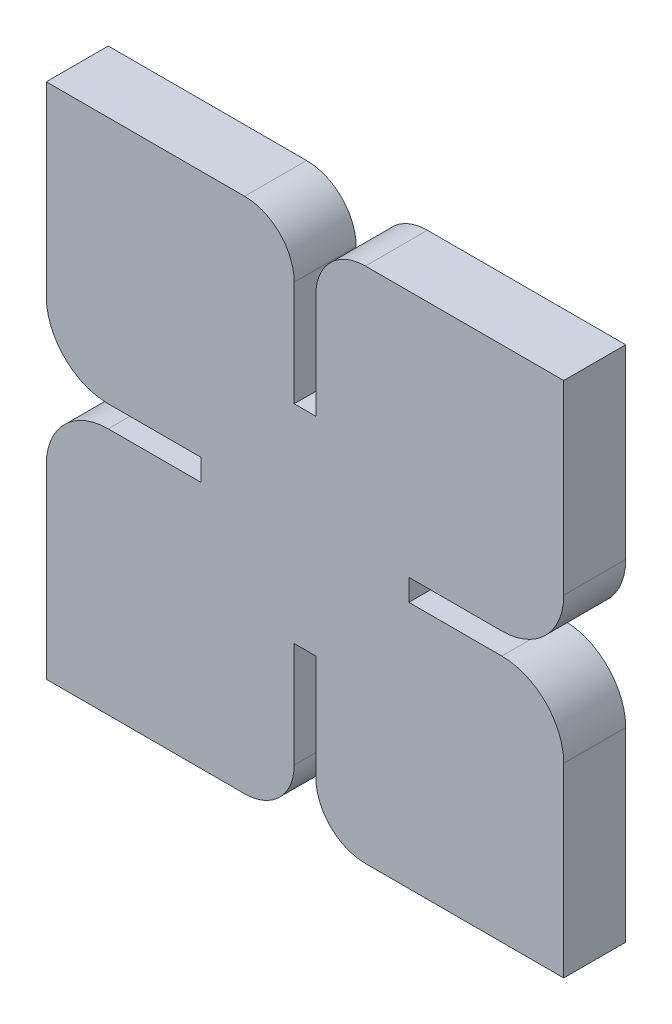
ISO-10303-21;
HEADER;
FILE_DESCRIPTION(('STEP AP214'),'2;1');
FILE_NAME('part.step','',(''),(''),'','','');
FILE_SCHEMA(('AUTOMOTIVE_DESIGN { 1 0 10303 214 1 1 1 1 }'));
ENDSEC;
DATA;
#1=APPLICATION_CONTEXT('core data for automotive mechanical design processes');
#2=APPLICATION_PROTOCOL_DEFINITION('international standard','automotive_design',2000,#1);
#3=PRODUCT_CONTEXT('',#1,'mechanical');
#4=PRODUCT('Part','Part','',(#3));
#5=PRODUCT_RELATED_PRODUCT_CATEGORY('part','',(#4));
#6=PRODUCT_DEFINITION_FORMATION('','',#4);
#7=PRODUCT_DEFINITION_CONTEXT('part definition',#1,'design');
#8=PRODUCT_DEFINITION('design','',#6,#7);
#9=PRODUCT_DEFINITION_SHAPE('','',#8);
#10=(LENGTH_UNIT() NAMED_UNIT(*) SI_UNIT(.MILLI.,.METRE.));
#11=(NAMED_UNIT(*) PLANE_ANGLE_UNIT() SI_UNIT($,.RADIAN.));
#12=(NAMED_UNIT(*) SI_UNIT($,.STERADIAN.) SOLID_ANGLE_UNIT());
#13=UNCERTAINTY_MEASURE_WITH_UNIT(LENGTH_MEASURE(1.E-05),#10,'distance_accuracy_value','');
#14=(GEOMETRIC_REPRESENTATION_CONTEXT(3) GLOBAL_UNCERTAINTY_ASSIGNED_CONTEXT((#13)) GLOBAL_UNIT_ASSIGNED_CONTEXT((#10,
#11,#12)) REPRESENTATION_CONTEXT('',''));
#15=CARTESIAN_POINT('',(0.,0.,0.));
#16=DIRECTION('',(0.,0.,1.));
#17=DIRECTION('',(1.,0.,0.));
#18=AXIS2_PLACEMENT_3D('',#15,#16,#17);
#19=CARTESIAN_POINT('',(-9.74999999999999,-33.75,10.));
#20=DIRECTION('',(0.,0.,-1.));
#21=DIRECTION('',(-1.,0.,0.));
#22=AXIS2_PLACEMENT_3D('',#19,#20,#21);
#23=CYLINDRICAL_SURFACE('',#22,8.);
#24=CARTESIAN_POINT('',(-9.74999999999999,-33.75,0.));
#25=DIRECTION('',(0.,0.,1.));
#26=DIRECTION('',(1.,0.,0.));
#27=AXIS2_PLACEMENT_3D('',#24,#25,#26);
#28=CIRCLE('',#27,8.);
#29=CARTESIAN_POINT('',(-1.74999999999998,-33.75,0.));
#30=VERTEX_POINT('',#29);
#31=CARTESIAN_POINT('',(-9.74999999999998,-41.75,0.));
#32=VERTEX_POINT('',#31);
#33=EDGE_CURVE('E246',#30,#32,#28,.F.);
#34=ORIENTED_EDGE('',*,*,#33,.F.);
#35=DIRECTION('',(0.,0.,-1.));
#36=VECTOR('',#35,1.);
#37=CARTESIAN_POINT('',(-1.74999999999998,-33.75,10.));
#38=LINE('',#37,#36);
#39=CARTESIAN_POINT('',(-1.74999999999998,-33.75,10.));
#40=VERTEX_POINT('',#39);
#41=EDGE_CURVE('E11',#40,#30,#38,.T.);
#42=ORIENTED_EDGE('',*,*,#41,.F.);
#43=CARTESIAN_POINT('',(-9.74999999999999,-33.75,10.));
#44=DIRECTION('',(0.,0.,1.));
#45=DIRECTION('',(1.,0.,0.));
#46=AXIS2_PLACEMENT_3D('',#43,#44,#45);
#47=CIRCLE('',#46,8.);
#48=CARTESIAN_POINT('',(-9.74999999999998,-41.75,10.));
#49=VERTEX_POINT('',#48);
#50=EDGE_CURVE('E319',#40,#49,#47,.F.);
#51=ORIENTED_EDGE('',*,*,#50,.T.);
#52=DIRECTION('',(0.,0.,-1.));
#53=VECTOR('',#52,1.);
#54=CARTESIAN_POINT('',(-9.74999999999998,-41.75,10.));
#55=LINE('',#54,#53);
#56=EDGE_CURVE('E146',#49,#32,#55,.T.);
#57=ORIENTED_EDGE('',*,*,#56,.T.);
#58=EDGE_LOOP('',(#34,#42,#51,#57));
#59=FACE_BOUND('',#58,.T.);
#60=ADVANCED_FACE('F35',(#59),#23,.T.);
#61=CARTESIAN_POINT('',(-1.75,0.,10.));
#62=DIRECTION('',(1.,0.,0.));
#63=DIRECTION('',(0.,1.,0.));
#64=AXIS2_PLACEMENT_3D('',#61,#62,#63);
#65=PLANE('',#64);
#66=DIRECTION('',(0.,-1.,0.));
#67=VECTOR('',#66,1.);
#68=CARTESIAN_POINT('',(-1.75,0.,0.));
#69=LINE('',#68,#67);
#70=CARTESIAN_POINT('',(-1.74999999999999,-16.75,0.));
#71=VERTEX_POINT('',#70);
#72=EDGE_CURVE('E249',#71,#30,#69,.T.);
#73=ORIENTED_EDGE('',*,*,#72,.F.);
#74=DIRECTION('',(0.,0.,-1.));
#75=VECTOR('',#74,1.);
#76=CARTESIAN_POINT('',(-1.74999999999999,-16.75,10.));
#77=LINE('',#76,#75);
#78=CARTESIAN_POINT('',(-1.74999999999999,-16.75,10.));
#79=VERTEX_POINT('',#78);
#80=EDGE_CURVE('E43',#79,#71,#77,.T.);
#81=ORIENTED_EDGE('',*,*,#80,.F.);
#82=DIRECTION('',(0.,-1.,0.));
#83=VECTOR('',#82,1.);
#84=CARTESIAN_POINT('',(-1.75,0.,10.));
#85=LINE('',#84,#83);
#86=EDGE_CURVE('E387',#79,#40,#85,.T.);
#87=ORIENTED_EDGE('',*,*,#86,.T.);
#88=ORIENTED_EDGE('',*,*,#41,.T.);
#89=EDGE_LOOP('',(#73,#81,#87,#88));
#90=FACE_BOUND('',#89,.T.);
#91=ADVANCED_FACE('F386',(#90),#65,.T.);
#92=CARTESIAN_POINT('',(0.,-16.75,10.));
#93=DIRECTION('',(0.,1.,0.));
#94=DIRECTION('',(0.,0.,1.));
#95=AXIS2_PLACEMENT_3D('',#92,#93,#94);
#96=PLANE('',#95);
#97=DIRECTION('',(1.,0.,0.));
#98=VECTOR('',#97,1.);
#99=CARTESIAN_POINT('',(0.,-16.75,0.));
#100=LINE('',#99,#98);
#101=CARTESIAN_POINT('',(1.75000000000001,-16.75,0.));
#102=VERTEX_POINT('',#101);
#103=EDGE_CURVE('E252',#71,#102,#100,.T.);
#104=ORIENTED_EDGE('',*,*,#103,.T.);
#105=DIRECTION('',(0.,0.,-1.));
#106=VECTOR('',#105,1.);
#107=CARTESIAN_POINT('',(1.75000000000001,-16.75,10.));
#108=LINE('',#107,#106);
#109=CARTESIAN_POINT('',(1.75000000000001,-16.75,10.));
#110=VERTEX_POINT('',#109);
#111=EDGE_CURVE('E370',#110,#102,#108,.T.);
#112=ORIENTED_EDGE('',*,*,#111,.F.);
#113=DIRECTION('',(1.,0.,0.));
#114=VECTOR('',#113,1.);
#115=CARTESIAN_POINT('',(0.,-16.75,10.));
#116=LINE('',#115,#114);
#117=EDGE_CURVE('E377',#79,#110,#116,.T.);
#118=ORIENTED_EDGE('',*,*,#117,.F.);
#119=ORIENTED_EDGE('',*,*,#80,.T.);
#120=EDGE_LOOP('',(#104,#112,#118,#119));
#121=FACE_BOUND('',#120,.T.);
#122=ADVANCED_FACE('F375',(#121),#96,.F.);
#123=CARTESIAN_POINT('',(1.75000000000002,0.,10.));
#124=DIRECTION('',(1.,0.,0.));
#125=DIRECTION('',(0.,1.,0.));
#126=AXIS2_PLACEMENT_3D('',#123,#124,#125);
#127=PLANE('',#126);
#128=DIRECTION('',(0.,-1.,0.));
#129=VECTOR('',#128,1.);
#130=CARTESIAN_POINT('',(1.75000000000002,0.,0.));
#131=LINE('',#130,#129);
#132=CARTESIAN_POINT('',(1.75000000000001,-33.75,0.));
#133=VERTEX_POINT('',#132);
#134=EDGE_CURVE('E254',#102,#133,#131,.T.);
#135=ORIENTED_EDGE('',*,*,#134,.T.);
#136=DIRECTION('',(0.,0.,-1.));
#137=VECTOR('',#136,1.);
#138=CARTESIAN_POINT('',(1.75000000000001,-33.75,10.));
#139=LINE('',#138,#137);
#140=CARTESIAN_POINT('',(1.75000000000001,-33.75,10.));
#141=VERTEX_POINT('',#140);
#142=EDGE_CURVE('E367',#141,#133,#139,.T.);
#143=ORIENTED_EDGE('',*,*,#142,.F.);
#144=DIRECTION('',(0.,-1.,0.));
#145=VECTOR('',#144,1.);
#146=CARTESIAN_POINT('',(1.75000000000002,0.,10.));
#147=LINE('',#146,#145);
#148=EDGE_CURVE('E395',#110,#141,#147,.T.);
#149=ORIENTED_EDGE('',*,*,#148,.F.);
#150=ORIENTED_EDGE('',*,*,#111,.T.);
#151=EDGE_LOOP('',(#135,#143,#149,#150));
#152=FACE_BOUND('',#151,.T.);
#153=ADVANCED_FACE('F538',(#152),#127,.F.);
#154=CARTESIAN_POINT('',(9.75000000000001,-33.75,10.));
#155=DIRECTION('',(0.,0.,-1.));
#156=DIRECTION('',(-1.,0.,0.));
#157=AXIS2_PLACEMENT_3D('',#154,#155,#156);
#158=CYLINDRICAL_SURFACE('',#157,8.);
#159=CARTESIAN_POINT('',(9.75000000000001,-33.75,0.));
#160=DIRECTION('',(0.,0.,1.));
#161=DIRECTION('',(1.,0.,0.));
#162=AXIS2_PLACEMENT_3D('',#159,#160,#161);
#163=CIRCLE('',#162,8.);
#164=CARTESIAN_POINT('',(9.75000000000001,-41.75,0.));
#165=VERTEX_POINT('',#164);
#166=EDGE_CURVE('E256',#133,#165,#163,.T.);
#167=ORIENTED_EDGE('',*,*,#166,.T.);
#168=DIRECTION('',(0.,0.,-1.));
#169=VECTOR('',#168,1.);
#170=CARTESIAN_POINT('',(9.75000000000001,-41.75,10.));
#171=LINE('',#170,#169);
#172=CARTESIAN_POINT('',(9.75000000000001,-41.75,10.));
#173=VERTEX_POINT('',#172);
#174=EDGE_CURVE('E365',#173,#165,#171,.T.);
#175=ORIENTED_EDGE('',*,*,#174,.F.);
#176=CARTESIAN_POINT('',(9.75000000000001,-33.75,10.));
#177=DIRECTION('',(0.,0.,1.));
#178=DIRECTION('',(1.,0.,0.));
#179=AXIS2_PLACEMENT_3D('',#176,#177,#178);
#180=CIRCLE('',#179,8.);
#181=EDGE_CURVE('E397',#141,#173,#180,.T.);
#182=ORIENTED_EDGE('',*,*,#181,.F.);
#183=ORIENTED_EDGE('',*,*,#142,.T.);
#184=EDGE_LOOP('',(#167,#175,#182,#183));
#185=FACE_BOUND('',#184,.T.);
#186=ADVANCED_FACE('F534',(#185),#158,.T.);
#187=CARTESIAN_POINT('',(0.,-41.75,10.));
#188=DIRECTION('',(0.,-1.,0.));
#189=DIRECTION('',(1.,0.,0.));
#190=AXIS2_PLACEMENT_3D('',#187,#188,#189);
#191=PLANE('',#190);
#192=DIRECTION('',(-1.,0.,0.));
#193=VECTOR('',#192,1.);
#194=CARTESIAN_POINT('',(0.,-41.75,0.));
#195=LINE('',#194,#193);
#196=CARTESIAN_POINT('',(41.75,-41.75,0.));
#197=VERTEX_POINT('',#196);
#198=EDGE_CURVE('E259',#197,#165,#195,.T.);
#199=ORIENTED_EDGE('',*,*,#198,.F.);
#200=DIRECTION('',(0.,0.,-1.));
#201=VECTOR('',#200,1.);
#202=CARTESIAN_POINT('',(41.75,-41.75,10.));
#203=LINE('',#202,#201);
#204=CARTESIAN_POINT('',(41.75,-41.75,10.));
#205=VERTEX_POINT('',#204);
#206=EDGE_CURVE('E363',#205,#197,#203,.T.);
#207=ORIENTED_EDGE('',*,*,#206,.F.);
#208=DIRECTION('',(-1.,0.,0.));
#209=VECTOR('',#208,1.);
#210=CARTESIAN_POINT('',(0.,-41.75,10.));
#211=LINE('',#210,#209);
#212=EDGE_CURVE('E399',#205,#173,#211,.T.);
#213=ORIENTED_EDGE('',*,*,#212,.T.);
#214=ORIENTED_EDGE('',*,*,#174,.T.);
#215=EDGE_LOOP('',(#199,#207,#213,#214));
#216=FACE_BOUND('',#215,.T.);
#217=ADVANCED_FACE('F529',(#216),#191,.T.);
#218=CARTESIAN_POINT('',(41.75,0.,10.));
#219=DIRECTION('',(1.,0.,0.));
#220=DIRECTION('',(0.,1.,0.));
#221=AXIS2_PLACEMENT_3D('',#218,#219,#220);
#222=PLANE('',#221);
#223=DIRECTION('',(0.,-1.,0.));
#224=VECTOR('',#223,1.);
#225=CARTESIAN_POINT('',(41.75,0.,0.));
#226=LINE('',#225,#224);
#227=CARTESIAN_POINT('',(41.75,-11.75,0.));
#228=VERTEX_POINT('',#227);
#229=EDGE_CURVE('E262',#228,#197,#226,.T.);
#230=ORIENTED_EDGE('',*,*,#229,.F.);
#231=DIRECTION('',(0.,0.,-1.));
#232=VECTOR('',#231,1.);
#233=CARTESIAN_POINT('',(41.75,-11.75,10.));
#234=LINE('',#233,#232);
#235=CARTESIAN_POINT('',(41.75,-11.75,10.));
#236=VERTEX_POINT('',#235);
#237=EDGE_CURVE('E361',#236,#228,#234,.T.);
#238=ORIENTED_EDGE('',*,*,#237,.F.);
#239=DIRECTION('',(0.,-1.,0.));
#240=VECTOR('',#239,1.);
#241=CARTESIAN_POINT('',(41.75,0.,10.));
#242=LINE('',#241,#240);
#243=EDGE_CURVE('E402',#236,#205,#242,.T.);
#244=ORIENTED_EDGE('',*,*,#243,.T.);
#245=ORIENTED_EDGE('',*,*,#206,.T.);
#246=EDGE_LOOP('',(#230,#238,#244,#245));
#247=FACE_BOUND('',#246,.T.);
#248=ADVANCED_FACE('F526',(#247),#222,.T.);
#249=CARTESIAN_POINT('',(31.75,-11.75,10.));
#250=DIRECTION('',(0.,0.,-1.));
#251=DIRECTION('',(-1.,0.,0.));
#252=AXIS2_PLACEMENT_3D('',#249,#250,#251);
#253=CYLINDRICAL_SURFACE('',#252,10.);
#254=CARTESIAN_POINT('',(31.75,-11.75,0.));
#255=DIRECTION('',(0.,0.,1.));
#256=DIRECTION('',(1.,0.,0.));
#257=AXIS2_PLACEMENT_3D('',#254,#255,#256);
#258=CIRCLE('',#257,10.);
#259=CARTESIAN_POINT('',(31.75,-1.75000000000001,0.));
#260=VERTEX_POINT('',#259);
#261=EDGE_CURVE('E265',#260,#228,#258,.F.);
#262=ORIENTED_EDGE('',*,*,#261,.F.);
#263=DIRECTION('',(0.,0.,-1.));
#264=VECTOR('',#263,1.);
#265=CARTESIAN_POINT('',(31.75,-1.75000000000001,10.));
#266=LINE('',#265,#264);
#267=CARTESIAN_POINT('',(31.75,-1.75000000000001,10.));
#268=VERTEX_POINT('',#267);
#269=EDGE_CURVE('E359',#268,#260,#266,.T.);
#270=ORIENTED_EDGE('',*,*,#269,.F.);
#271=CARTESIAN_POINT('',(31.75,-11.75,10.));
#272=DIRECTION('',(0.,0.,1.));
#273=DIRECTION('',(1.,0.,0.));
#274=AXIS2_PLACEMENT_3D('',#271,#272,#273);
#275=CIRCLE('',#274,10.);
#276=EDGE_CURVE('E405',#268,#236,#275,.F.);
#277=ORIENTED_EDGE('',*,*,#276,.T.);
#278=ORIENTED_EDGE('',*,*,#237,.T.);
#279=EDGE_LOOP('',(#262,#270,#277,#278));
#280=FACE_BOUND('',#279,.T.);
#281=ADVANCED_FACE('F520',(#280),#253,.T.);
#282=CARTESIAN_POINT('',(0.,-1.75,10.));
#283=DIRECTION('',(0.,-1.,0.));
#284=DIRECTION('',(1.,0.,0.));
#285=AXIS2_PLACEMENT_3D('',#282,#283,#284);
#286=PLANE('',#285);
#287=DIRECTION('',(-1.,0.,0.));
#288=VECTOR('',#287,1.);
#289=CARTESIAN_POINT('',(0.,-1.75,0.));
#290=LINE('',#289,#288);
#291=CARTESIAN_POINT('',(16.75,-1.75,0.));
#292=VERTEX_POINT('',#291);
#293=EDGE_CURVE('E268',#260,#292,#290,.T.);
#294=ORIENTED_EDGE('',*,*,#293,.T.);
#295=DIRECTION('',(0.,0.,-1.));
#296=VECTOR('',#295,1.);
#297=CARTESIAN_POINT('',(16.75,-1.75,10.));
#298=LINE('',#297,#296);
#299=CARTESIAN_POINT('',(16.75,-1.75,10.));
#300=VERTEX_POINT('',#299);
#301=EDGE_CURVE('E357',#300,#292,#298,.T.);
#302=ORIENTED_EDGE('',*,*,#301,.F.);
#303=DIRECTION('',(-1.,0.,0.));
#304=VECTOR('',#303,1.);
#305=CARTESIAN_POINT('',(0.,-1.75,10.));
#306=LINE('',#305,#304);
#307=EDGE_CURVE('E408',#268,#300,#306,.T.);
#308=ORIENTED_EDGE('',*,*,#307,.F.);
#309=ORIENTED_EDGE('',*,*,#269,.T.);
#310=EDGE_LOOP('',(#294,#302,#308,#309));
#311=FACE_BOUND('',#310,.T.);
#312=ADVANCED_FACE('F539',(#311),#286,.F.);
#313=CARTESIAN_POINT('',(16.75,0.,10.));
#314=DIRECTION('',(1.,0.,0.));
#315=DIRECTION('',(0.,0.,-1.));
#316=AXIS2_PLACEMENT_3D('',#313,#314,#315);
#317=PLANE('',#316);
#318=DIRECTION('',(0.,-1.,0.));
#319=VECTOR('',#318,1.);
#320=CARTESIAN_POINT('',(16.75,0.,0.));
#321=LINE('',#320,#319);
#322=CARTESIAN_POINT('',(16.75,1.75,0.));
#323=VERTEX_POINT('',#322);
#324=EDGE_CURVE('E271',#323,#292,#321,.T.);
#325=ORIENTED_EDGE('',*,*,#324,.F.);
#326=DIRECTION('',(0.,0.,-1.));
#327=VECTOR('',#326,1.);
#328=CARTESIAN_POINT('',(16.75,1.75,10.));
#329=LINE('',#328,#327);
#330=CARTESIAN_POINT('',(16.75,1.75,10.));
#331=VERTEX_POINT('',#330);
#332=EDGE_CURVE('E355',#331,#323,#329,.T.);
#333=ORIENTED_EDGE('',*,*,#332,.F.);
#334=DIRECTION('',(0.,-1.,0.));
#335=VECTOR('',#334,1.);
#336=CARTESIAN_POINT('',(16.75,0.,10.));
#337=LINE('',#336,#335);
#338=EDGE_CURVE('E410',#331,#300,#337,.T.);
#339=ORIENTED_EDGE('',*,*,#338,.T.);
#340=ORIENTED_EDGE('',*,*,#301,.T.);
#341=EDGE_LOOP('',(#325,#333,#339,#340));
#342=FACE_BOUND('',#341,.T.);
#343=ADVANCED_FACE('F514',(#342),#317,.T.);
#344=CARTESIAN_POINT('',(0.,1.75,10.));
#345=DIRECTION('',(0.,-1.,0.));
#346=DIRECTION('',(1.,0.,0.));
#347=AXIS2_PLACEMENT_3D('',#344,#345,#346);
#348=PLANE('',#347);
#349=DIRECTION('',(-1.,0.,0.));
#350=VECTOR('',#349,1.);
#351=CARTESIAN_POINT('',(0.,1.75,0.));
#352=LINE('',#351,#350);
#353=CARTESIAN_POINT('',(31.75,1.75000000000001,0.));
#354=VERTEX_POINT('',#353);
#355=EDGE_CURVE('E274',#354,#323,#352,.T.);
#356=ORIENTED_EDGE('',*,*,#355,.F.);
#357=DIRECTION('',(0.,0.,-1.));
#358=VECTOR('',#357,1.);
#359=CARTESIAN_POINT('',(31.75,1.75000000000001,10.));
#360=LINE('',#359,#358);
#361=CARTESIAN_POINT('',(31.75,1.75000000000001,10.));
#362=VERTEX_POINT('',#361);
#363=EDGE_CURVE('E353',#362,#354,#360,.T.);
#364=ORIENTED_EDGE('',*,*,#363,.F.);
#365=DIRECTION('',(-1.,0.,0.));
#366=VECTOR('',#365,1.);
#367=CARTESIAN_POINT('',(0.,1.75,10.));
#368=LINE('',#367,#366);
#369=EDGE_CURVE('E413',#362,#331,#368,.T.);
#370=ORIENTED_EDGE('',*,*,#369,.T.);
#371=ORIENTED_EDGE('',*,*,#332,.T.);
#372=EDGE_LOOP('',(#356,#364,#370,#371));
#373=FACE_BOUND('',#372,.T.);
#374=ADVANCED_FACE('F508',(#373),#348,.T.);
#375=CARTESIAN_POINT('',(31.75,11.75,10.));
#376=DIRECTION('',(0.,0.,-1.));
#377=DIRECTION('',(-1.,0.,0.));
#378=AXIS2_PLACEMENT_3D('',#375,#376,#377);
#379=CYLINDRICAL_SURFACE('',#378,10.);
#380=CARTESIAN_POINT('',(31.75,11.75,0.));
#381=DIRECTION('',(0.,0.,1.));
#382=DIRECTION('',(1.,0.,0.));
#383=AXIS2_PLACEMENT_3D('',#380,#381,#382);
#384=CIRCLE('',#383,10.);
#385=CARTESIAN_POINT('',(41.75,11.75,0.));
#386=VERTEX_POINT('',#385);
#387=EDGE_CURVE('E277',#354,#386,#384,.T.);
#388=ORIENTED_EDGE('',*,*,#387,.T.);
#389=DIRECTION('',(0.,0.,-1.));
#390=VECTOR('',#389,1.);
#391=CARTESIAN_POINT('',(41.75,11.75,10.));
#392=LINE('',#391,#390);
#393=CARTESIAN_POINT('',(41.75,11.75,10.));
#394=VERTEX_POINT('',#393);
#395=EDGE_CURVE('E350',#394,#386,#392,.T.);
#396=ORIENTED_EDGE('',*,*,#395,.F.);
#397=CARTESIAN_POINT('',(31.75,11.75,10.));
#398=DIRECTION('',(0.,0.,1.));
#399=DIRECTION('',(1.,0.,0.));
#400=AXIS2_PLACEMENT_3D('',#397,#398,#399);
#401=CIRCLE('',#400,10.);
#402=EDGE_CURVE('E416',#362,#394,#401,.T.);
#403=ORIENTED_EDGE('',*,*,#402,.F.);
#404=ORIENTED_EDGE('',*,*,#363,.T.);
#405=EDGE_LOOP('',(#388,#396,#403,#404));
#406=FACE_BOUND('',#405,.T.);
#407=ADVANCED_FACE('F591',(#406),#379,.T.);
#408=CARTESIAN_POINT('',(41.75,0.,10.));
#409=DIRECTION('',(-1.,0.,0.));
#410=DIRECTION('',(0.,-1.,0.));
#411=AXIS2_PLACEMENT_3D('',#408,#409,#410);
#412=PLANE('',#411);
#413=DIRECTION('',(0.,1.,0.));
#414=VECTOR('',#413,1.);
#415=CARTESIAN_POINT('',(41.75,0.,0.));
#416=LINE('',#415,#414);
#417=CARTESIAN_POINT('',(41.75,41.75,0.));
#418=VERTEX_POINT('',#417);
#419=EDGE_CURVE('E279',#386,#418,#416,.T.);
#420=ORIENTED_EDGE('',*,*,#419,.T.);
#421=DIRECTION('',(0.,0.,-1.));
#422=VECTOR('',#421,1.);
#423=CARTESIAN_POINT('',(41.75,41.75,10.));
#424=LINE('',#423,#422);
#425=CARTESIAN_POINT('',(41.75,41.75,10.));
#426=VERTEX_POINT('',#425);
#427=EDGE_CURVE('E347',#426,#418,#424,.T.);
#428=ORIENTED_EDGE('',*,*,#427,.F.);
#429=DIRECTION('',(0.,1.,0.));
#430=VECTOR('',#429,1.);
#431=CARTESIAN_POINT('',(41.75,0.,10.));
#432=LINE('',#431,#430);
#433=EDGE_CURVE('E418',#394,#426,#432,.T.);
#434=ORIENTED_EDGE('',*,*,#433,.F.);
#435=ORIENTED_EDGE('',*,*,#395,.T.);
#436=EDGE_LOOP('',(#420,#428,#434,#435));
#437=FACE_BOUND('',#436,.T.);
#438=ADVANCED_FACE('F502',(#437),#412,.F.);
#439=CARTESIAN_POINT('',(0.,41.75,10.));
#440=DIRECTION('',(0.,-1.,0.));
#441=DIRECTION('',(1.,0.,0.));
#442=AXIS2_PLACEMENT_3D('',#439,#440,#441);
#443=PLANE('',#442);
#444=DIRECTION('',(-1.,0.,0.));
#445=VECTOR('',#444,1.);
#446=CARTESIAN_POINT('',(0.,41.75,0.));
#447=LINE('',#446,#445);
#448=CARTESIAN_POINT('',(9.75000000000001,41.75,0.));
#449=VERTEX_POINT('',#448);
#450=EDGE_CURVE('E281',#418,#449,#447,.T.);
#451=ORIENTED_EDGE('',*,*,#450,.T.);
#452=DIRECTION('',(0.,0.,-1.));
#453=VECTOR('',#452,1.);
#454=CARTESIAN_POINT('',(9.75000000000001,41.75,10.));
#455=LINE('',#454,#453);
#456=CARTESIAN_POINT('',(9.75000000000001,41.75,10.));
#457=VERTEX_POINT('',#456);
#458=EDGE_CURVE('E345',#457,#449,#455,.T.);
#459=ORIENTED_EDGE('',*,*,#458,.F.);
#460=DIRECTION('',(-1.,0.,0.));
#461=VECTOR('',#460,1.);
#462=CARTESIAN_POINT('',(0.,41.75,10.));
#463=LINE('',#462,#461);
#464=EDGE_CURVE('E420',#426,#457,#463,.T.);
#465=ORIENTED_EDGE('',*,*,#464,.F.);
#466=ORIENTED_EDGE('',*,*,#427,.T.);
#467=EDGE_LOOP('',(#451,#459,#465,#466));
#468=FACE_BOUND('',#467,.T.);
#469=ADVANCED_FACE('F498',(#468),#443,.F.);
#470=CARTESIAN_POINT('',(9.75000000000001,33.75,10.));
#471=DIRECTION('',(0.,0.,-1.));
#472=DIRECTION('',(-1.,0.,0.));
#473=AXIS2_PLACEMENT_3D('',#470,#471,#472);
#474=CYLINDRICAL_SURFACE('',#473,8.);
#475=CARTESIAN_POINT('',(9.75000000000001,33.75,0.));
#476=DIRECTION('',(0.,0.,1.));
#477=DIRECTION('',(1.,0.,0.));
#478=AXIS2_PLACEMENT_3D('',#475,#476,#477);
#479=CIRCLE('',#478,8.);
#480=CARTESIAN_POINT('',(1.75000000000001,33.75,0.));
#481=VERTEX_POINT('',#480);
#482=EDGE_CURVE('E284',#481,#449,#479,.F.);
#483=ORIENTED_EDGE('',*,*,#482,.F.);
#484=DIRECTION('',(0.,0.,-1.));
#485=VECTOR('',#484,1.);
#486=CARTESIAN_POINT('',(1.75000000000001,33.75,10.));
#487=LINE('',#486,#485);
#488=CARTESIAN_POINT('',(1.75000000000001,33.75,10.));
#489=VERTEX_POINT('',#488);
#490=EDGE_CURVE('E343',#489,#481,#487,.T.);
#491=ORIENTED_EDGE('',*,*,#490,.F.);
#492=CARTESIAN_POINT('',(9.75000000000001,33.75,10.));
#493=DIRECTION('',(0.,0.,1.));
#494=DIRECTION('',(1.,0.,0.));
#495=AXIS2_PLACEMENT_3D('',#492,#493,#494);
#496=CIRCLE('',#495,8.);
#497=EDGE_CURVE('E422',#489,#457,#496,.F.);
#498=ORIENTED_EDGE('',*,*,#497,.T.);
#499=ORIENTED_EDGE('',*,*,#458,.T.);
#500=EDGE_LOOP('',(#483,#491,#498,#499));
#501=FACE_BOUND('',#500,.T.);
#502=ADVANCED_FACE('F493',(#501),#474,.T.);
#503=CARTESIAN_POINT('',(1.75000000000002,0.,10.));
#504=DIRECTION('',(-1.,0.,0.));
#505=DIRECTION('',(0.,-1.,0.));
#506=AXIS2_PLACEMENT_3D('',#503,#504,#505);
#507=PLANE('',#506);
#508=DIRECTION('',(0.,1.,0.));
#509=VECTOR('',#508,1.);
#510=CARTESIAN_POINT('',(1.75000000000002,0.,0.));
#511=LINE('',#510,#509);
#512=CARTESIAN_POINT('',(1.75000000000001,16.75,0.));
#513=VERTEX_POINT('',#512);
#514=EDGE_CURVE('E287',#513,#481,#511,.T.);
#515=ORIENTED_EDGE('',*,*,#514,.F.);
#516=DIRECTION('',(0.,0.,-1.));
#517=VECTOR('',#516,1.);
#518=CARTESIAN_POINT('',(1.75000000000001,16.75,10.));
#519=LINE('',#518,#517);
#520=CARTESIAN_POINT('',(1.75000000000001,16.75,10.));
#521=VERTEX_POINT('',#520);
#522=EDGE_CURVE('E341',#521,#513,#519,.T.);
#523=ORIENTED_EDGE('',*,*,#522,.F.);
#524=DIRECTION('',(0.,1.,0.));
#525=VECTOR('',#524,1.);
#526=CARTESIAN_POINT('',(1.75000000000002,0.,10.));
#527=LINE('',#526,#525);
#528=EDGE_CURVE('E425',#521,#489,#527,.T.);
#529=ORIENTED_EDGE('',*,*,#528,.T.);
#530=ORIENTED_EDGE('',*,*,#490,.T.);
#531=EDGE_LOOP('',(#515,#523,#529,#530));
#532=FACE_BOUND('',#531,.T.);
#533=ADVANCED_FACE('F488',(#532),#507,.T.);
#534=CARTESIAN_POINT('',(0.,16.75,10.));
#535=DIRECTION('',(0.,1.,0.));
#536=DIRECTION('',(0.,0.,1.));
#537=AXIS2_PLACEMENT_3D('',#534,#535,#536);
#538=PLANE('',#537);
#539=DIRECTION('',(1.,0.,0.));
#540=VECTOR('',#539,1.);
#541=CARTESIAN_POINT('',(0.,16.75,0.));
#542=LINE('',#541,#540);
#543=CARTESIAN_POINT('',(-1.75,16.75,0.));
#544=VERTEX_POINT('',#543);
#545=EDGE_CURVE('E290',#544,#513,#542,.T.);
#546=ORIENTED_EDGE('',*,*,#545,.F.);
#547=DIRECTION('',(0.,0.,-1.));
#548=VECTOR('',#547,1.);
#549=CARTESIAN_POINT('',(-1.75,16.75,10.));
#550=LINE('',#549,#548);
#551=CARTESIAN_POINT('',(-1.75,16.75,10.));
#552=VERTEX_POINT('',#551);
#553=EDGE_CURVE('E339',#552,#544,#550,.T.);
#554=ORIENTED_EDGE('',*,*,#553,.F.);
#555=DIRECTION('',(1.,0.,0.));
#556=VECTOR('',#555,1.);
#557=CARTESIAN_POINT('',(0.,16.75,10.));
#558=LINE('',#557,#556);
#559=EDGE_CURVE('E428',#552,#521,#558,.T.);
#560=ORIENTED_EDGE('',*,*,#559,.T.);
#561=ORIENTED_EDGE('',*,*,#522,.T.);
#562=EDGE_LOOP('',(#546,#554,#560,#561));
#563=FACE_BOUND('',#562,.T.);
#564=ADVANCED_FACE('F482',(#563),#538,.T.);
#565=CARTESIAN_POINT('',(-1.75,0.,10.));
#566=DIRECTION('',(-1.,0.,0.));
#567=DIRECTION('',(0.,-1.,0.));
#568=AXIS2_PLACEMENT_3D('',#565,#566,#567);
#569=PLANE('',#568);
#570=DIRECTION('',(0.,1.,0.));
#571=VECTOR('',#570,1.);
#572=CARTESIAN_POINT('',(-1.75,0.,0.));
#573=LINE('',#572,#571);
#574=CARTESIAN_POINT('',(-1.75,33.75,0.));
#575=VERTEX_POINT('',#574);
#576=EDGE_CURVE('E293',#544,#575,#573,.T.);
#577=ORIENTED_EDGE('',*,*,#576,.T.);
#578=DIRECTION('',(0.,0.,-1.));
#579=VECTOR('',#578,1.);
#580=CARTESIAN_POINT('',(-1.75,33.75,10.));
#581=LINE('',#580,#579);
#582=CARTESIAN_POINT('',(-1.75,33.75,10.));
#583=VERTEX_POINT('',#582);
#584=EDGE_CURVE('E336',#583,#575,#581,.T.);
#585=ORIENTED_EDGE('',*,*,#584,.F.);
#586=DIRECTION('',(0.,1.,0.));
#587=VECTOR('',#586,1.);
#588=CARTESIAN_POINT('',(-1.75,0.,10.));
#589=LINE('',#588,#587);
#590=EDGE_CURVE('E431',#552,#583,#589,.T.);
#591=ORIENTED_EDGE('',*,*,#590,.F.);
#592=ORIENTED_EDGE('',*,*,#553,.T.);
#593=EDGE_LOOP('',(#577,#585,#591,#592));
#594=FACE_BOUND('',#593,.T.);
#595=ADVANCED_FACE('F640',(#594),#569,.F.);
#596=CARTESIAN_POINT('',(-9.75,33.75,10.));
#597=DIRECTION('',(0.,0.,-1.));
#598=DIRECTION('',(-1.,0.,0.));
#599=AXIS2_PLACEMENT_3D('',#596,#597,#598);
#600=CYLINDRICAL_SURFACE('',#599,8.);
#601=CARTESIAN_POINT('',(-9.75,33.75,0.));
#602=DIRECTION('',(0.,0.,1.));
#603=DIRECTION('',(1.,0.,0.));
#604=AXIS2_PLACEMENT_3D('',#601,#602,#603);
#605=CIRCLE('',#604,8.);
#606=CARTESIAN_POINT('',(-9.75,41.75,0.));
#607=VERTEX_POINT('',#606);
#608=EDGE_CURVE('E295',#575,#607,#605,.T.);
#609=ORIENTED_EDGE('',*,*,#608,.T.);
#610=DIRECTION('',(0.,0.,-1.));
#611=VECTOR('',#610,1.);
#612=CARTESIAN_POINT('',(-9.75,41.75,10.));
#613=LINE('',#612,#611);
#614=CARTESIAN_POINT('',(-9.75,41.75,10.));
#615=VERTEX_POINT('',#614);
#616=EDGE_CURVE('E334',#615,#607,#613,.T.);
#617=ORIENTED_EDGE('',*,*,#616,.F.);
#618=CARTESIAN_POINT('',(-9.75,33.75,10.));
#619=DIRECTION('',(0.,0.,1.));
#620=DIRECTION('',(1.,0.,0.));
#621=AXIS2_PLACEMENT_3D('',#618,#619,#620);
#622=CIRCLE('',#621,8.);
#623=EDGE_CURVE('E433',#583,#615,#622,.T.);
#624=ORIENTED_EDGE('',*,*,#623,.F.);
#625=ORIENTED_EDGE('',*,*,#584,.T.);
#626=EDGE_LOOP('',(#609,#617,#624,#625));
#627=FACE_BOUND('',#626,.T.);
#628=ADVANCED_FACE('F476',(#627),#600,.T.);
#629=CARTESIAN_POINT('',(0.,41.75,10.));
#630=DIRECTION('',(0.,1.,0.));
#631=DIRECTION('',(0.,0.,1.));
#632=AXIS2_PLACEMENT_3D('',#629,#630,#631);
#633=PLANE('',#632);
#634=DIRECTION('',(1.,0.,0.));
#635=VECTOR('',#634,1.);
#636=CARTESIAN_POINT('',(0.,41.75,0.));
#637=LINE('',#636,#635);
#638=CARTESIAN_POINT('',(-41.75,41.75,0.));
#639=VERTEX_POINT('',#638);
#640=EDGE_CURVE('E298',#639,#607,#637,.T.);
#641=ORIENTED_EDGE('',*,*,#640,.F.);
#642=DIRECTION('',(0.,0.,-1.));
#643=VECTOR('',#642,1.);
#644=CARTESIAN_POINT('',(-41.75,41.75,10.));
#645=LINE('',#644,#643);
#646=CARTESIAN_POINT('',(-41.75,41.75,10.));
#647=VERTEX_POINT('',#646);
#648=EDGE_CURVE('E332',#647,#639,#645,.T.);
#649=ORIENTED_EDGE('',*,*,#648,.F.);
#650=DIRECTION('',(1.,0.,0.));
#651=VECTOR('',#650,1.);
#652=CARTESIAN_POINT('',(0.,41.75,10.));
#653=LINE('',#652,#651);
#654=EDGE_CURVE('E435',#647,#615,#653,.T.);
#655=ORIENTED_EDGE('',*,*,#654,.T.);
#656=ORIENTED_EDGE('',*,*,#616,.T.);
#657=EDGE_LOOP('',(#641,#649,#655,#656));
#658=FACE_BOUND('',#657,.T.);
#659=ADVANCED_FACE('F472',(#658),#633,.T.);
#660=CARTESIAN_POINT('',(-41.75,0.,10.));
#661=DIRECTION('',(-1.,0.,0.));
#662=DIRECTION('',(0.,-1.,0.));
#663=AXIS2_PLACEMENT_3D('',#660,#661,#662);
#664=PLANE('',#663);
#665=DIRECTION('',(0.,1.,0.));
#666=VECTOR('',#665,1.);
#667=CARTESIAN_POINT('',(-41.75,0.,0.));
#668=LINE('',#667,#666);
#669=CARTESIAN_POINT('',(-41.75,11.75,0.));
#670=VERTEX_POINT('',#669);
#671=EDGE_CURVE('E301',#670,#639,#668,.T.);
#672=ORIENTED_EDGE('',*,*,#671,.F.);
#673=DIRECTION('',(0.,0.,-1.));
#674=VECTOR('',#673,1.);
#675=CARTESIAN_POINT('',(-41.75,11.75,10.));
#676=LINE('',#675,#674);
#677=CARTESIAN_POINT('',(-41.75,11.75,10.));
#678=VERTEX_POINT('',#677);
#679=EDGE_CURVE('E330',#678,#670,#676,.T.);
#680=ORIENTED_EDGE('',*,*,#679,.F.);
#681=DIRECTION('',(0.,1.,0.));
#682=VECTOR('',#681,1.);
#683=CARTESIAN_POINT('',(-41.75,0.,10.));
#684=LINE('',#683,#682);
#685=EDGE_CURVE('E438',#678,#647,#684,.T.);
#686=ORIENTED_EDGE('',*,*,#685,.T.);
#687=ORIENTED_EDGE('',*,*,#648,.T.);
#688=EDGE_LOOP('',(#672,#680,#686,#687));
#689=FACE_BOUND('',#688,.T.);
#690=ADVANCED_FACE('F468',(#689),#664,.T.);
#691=CARTESIAN_POINT('',(-31.75,11.75,10.));
#692=DIRECTION('',(0.,0.,-1.));
#693=DIRECTION('',(-1.,0.,0.));
#694=AXIS2_PLACEMENT_3D('',#691,#692,#693);
#695=CYLINDRICAL_SURFACE('',#694,10.);
#696=CARTESIAN_POINT('',(-31.75,11.75,0.));
#697=DIRECTION('',(0.,0.,1.));
#698=DIRECTION('',(1.,0.,0.));
#699=AXIS2_PLACEMENT_3D('',#696,#697,#698);
#700=CIRCLE('',#699,10.);
#701=CARTESIAN_POINT('',(-31.75,1.75,0.));
#702=VERTEX_POINT('',#701);
#703=EDGE_CURVE('E304',#702,#670,#700,.F.);
#704=ORIENTED_EDGE('',*,*,#703,.F.);
#705=DIRECTION('',(0.,0.,-1.));
#706=VECTOR('',#705,1.);
#707=CARTESIAN_POINT('',(-31.75,1.75,10.));
#708=LINE('',#707,#706);
#709=CARTESIAN_POINT('',(-31.75,1.75,10.));
#710=VERTEX_POINT('',#709);
#711=EDGE_CURVE('E328',#710,#702,#708,.T.);
#712=ORIENTED_EDGE('',*,*,#711,.F.);
#713=CARTESIAN_POINT('',(-31.75,11.75,10.));
#714=DIRECTION('',(0.,0.,1.));
#715=DIRECTION('',(1.,0.,0.));
#716=AXIS2_PLACEMENT_3D('',#713,#714,#715);
#717=CIRCLE('',#716,10.);
#718=EDGE_CURVE('E441',#710,#678,#717,.F.);
#719=ORIENTED_EDGE('',*,*,#718,.T.);
#720=ORIENTED_EDGE('',*,*,#679,.T.);
#721=EDGE_LOOP('',(#704,#712,#719,#720));
#722=FACE_BOUND('',#721,.T.);
#723=ADVANCED_FACE('F463',(#722),#695,.T.);
#724=CARTESIAN_POINT('',(0.,1.75,10.));
#725=DIRECTION('',(0.,1.,0.));
#726=DIRECTION('',(-1.,0.,0.));
#727=AXIS2_PLACEMENT_3D('',#724,#725,#726);
#728=PLANE('',#727);
#729=DIRECTION('',(1.,0.,0.));
#730=VECTOR('',#729,1.);
#731=CARTESIAN_POINT('',(0.,1.75,0.));
#732=LINE('',#731,#730);
#733=CARTESIAN_POINT('',(-16.75,1.75,0.));
#734=VERTEX_POINT('',#733);
#735=EDGE_CURVE('E307',#702,#734,#732,.T.);
#736=ORIENTED_EDGE('',*,*,#735,.T.);
#737=DIRECTION('',(0.,0.,-1.));
#738=VECTOR('',#737,1.);
#739=CARTESIAN_POINT('',(-16.75,1.75,10.));
#740=LINE('',#739,#738);
#741=CARTESIAN_POINT('',(-16.75,1.75,10.));
#742=VERTEX_POINT('',#741);
#743=EDGE_CURVE('E325',#742,#734,#740,.T.);
#744=ORIENTED_EDGE('',*,*,#743,.F.);
#745=DIRECTION('',(1.,0.,0.));
#746=VECTOR('',#745,1.);
#747=CARTESIAN_POINT('',(0.,1.75,10.));
#748=LINE('',#747,#746);
#749=EDGE_CURVE('E444',#710,#742,#748,.T.);
#750=ORIENTED_EDGE('',*,*,#749,.F.);
#751=ORIENTED_EDGE('',*,*,#711,.T.);
#752=EDGE_LOOP('',(#736,#744,#750,#751));
#753=FACE_BOUND('',#752,.T.);
#754=ADVANCED_FACE('F460',(#753),#728,.F.);
#755=CARTESIAN_POINT('',(-16.75,0.,10.));
#756=DIRECTION('',(1.,0.,0.));
#757=DIRECTION('',(0.,0.,-1.));
#758=AXIS2_PLACEMENT_3D('',#755,#756,#757);
#759=PLANE('',#758);
#760=DIRECTION('',(0.,-1.,0.));
#761=VECTOR('',#760,1.);
#762=CARTESIAN_POINT('',(-16.75,0.,0.));
#763=LINE('',#762,#761);
#764=CARTESIAN_POINT('',(-16.75,-1.75000000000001,0.));
#765=VERTEX_POINT('',#764);
#766=EDGE_CURVE('E309',#734,#765,#763,.T.);
#767=ORIENTED_EDGE('',*,*,#766,.T.);
#768=DIRECTION('',(0.,0.,-1.));
#769=VECTOR('',#768,1.);
#770=CARTESIAN_POINT('',(-16.75,-1.75000000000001,10.));
#771=LINE('',#770,#769);
#772=CARTESIAN_POINT('',(-16.75,-1.75000000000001,10.));
#773=VERTEX_POINT('',#772);
#774=EDGE_CURVE('E323',#773,#765,#771,.T.);
#775=ORIENTED_EDGE('',*,*,#774,.F.);
#776=DIRECTION('',(0.,-1.,0.));
#777=VECTOR('',#776,1.);
#778=CARTESIAN_POINT('',(-16.75,0.,10.));
#779=LINE('',#778,#777);
#780=EDGE_CURVE('E446',#742,#773,#779,.T.);
#781=ORIENTED_EDGE('',*,*,#780,.F.);
#782=ORIENTED_EDGE('',*,*,#743,.T.);
#783=EDGE_LOOP('',(#767,#775,#781,#782));
#784=FACE_BOUND('',#783,.T.);
#785=ADVANCED_FACE('F455',(#784),#759,.F.);
#786=CARTESIAN_POINT('',(0.,-1.75,10.));
#787=DIRECTION('',(0.,1.,0.));
#788=DIRECTION('',(-1.,0.,0.));
#789=AXIS2_PLACEMENT_3D('',#786,#787,#788);
#790=PLANE('',#789);
#791=DIRECTION('',(1.,0.,0.));
#792=VECTOR('',#791,1.);
#793=CARTESIAN_POINT('',(0.,-1.75,0.));
#794=LINE('',#793,#792);
#795=CARTESIAN_POINT('',(-31.75,-1.75000000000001,0.));
#796=VERTEX_POINT('',#795);
#797=EDGE_CURVE('E312',#796,#765,#794,.T.);
#798=ORIENTED_EDGE('',*,*,#797,.F.);
#799=DIRECTION('',(0.,0.,-1.));
#800=VECTOR('',#799,1.);
#801=CARTESIAN_POINT('',(-31.75,-1.75000000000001,10.));
#802=LINE('',#801,#800);
#803=CARTESIAN_POINT('',(-31.75,-1.75000000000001,10.));
#804=VERTEX_POINT('',#803);
#805=EDGE_CURVE('E238',#804,#796,#802,.T.);
#806=ORIENTED_EDGE('',*,*,#805,.F.);
#807=DIRECTION('',(1.,0.,0.));
#808=VECTOR('',#807,1.);
#809=CARTESIAN_POINT('',(0.,-1.75,10.));
#810=LINE('',#809,#808);
#811=EDGE_CURVE('E231',#804,#773,#810,.T.);
#812=ORIENTED_EDGE('',*,*,#811,.T.);
#813=ORIENTED_EDGE('',*,*,#774,.T.);
#814=EDGE_LOOP('',(#798,#806,#812,#813));
#815=FACE_BOUND('',#814,.T.);
#816=ADVANCED_FACE('F449',(#815),#790,.T.);
#817=CARTESIAN_POINT('',(-31.75,-11.75,10.));
#818=DIRECTION('',(0.,0.,-1.));
#819=DIRECTION('',(-1.,0.,0.));
#820=AXIS2_PLACEMENT_3D('',#817,#818,#819);
#821=CYLINDRICAL_SURFACE('',#820,10.);
#822=CARTESIAN_POINT('',(-31.75,-11.75,0.));
#823=DIRECTION('',(0.,0.,1.));
#824=DIRECTION('',(1.,0.,0.));
#825=AXIS2_PLACEMENT_3D('',#822,#823,#824);
#826=CIRCLE('',#825,10.);
#827=CARTESIAN_POINT('',(-41.75,-11.75,0.));
#828=VERTEX_POINT('',#827);
#829=EDGE_CURVE('E237',#796,#828,#826,.T.);
#830=ORIENTED_EDGE('',*,*,#829,.T.);
#831=DIRECTION('',(0.,0.,-1.));
#832=VECTOR('',#831,1.);
#833=CARTESIAN_POINT('',(-41.75,-11.75,10.));
#834=LINE('',#833,#832);
#835=CARTESIAN_POINT('',(-41.75,-11.75,10.));
#836=VERTEX_POINT('',#835);
#837=EDGE_CURVE('E234',#836,#828,#834,.T.);
#838=ORIENTED_EDGE('',*,*,#837,.F.);
#839=CARTESIAN_POINT('',(-31.75,-11.75,10.));
#840=DIRECTION('',(0.,0.,1.));
#841=DIRECTION('',(1.,0.,0.));
#842=AXIS2_PLACEMENT_3D('',#839,#840,#841);
#843=CIRCLE('',#842,10.);
#844=EDGE_CURVE('E225',#804,#836,#843,.T.);
#845=ORIENTED_EDGE('',*,*,#844,.F.);
#846=ORIENTED_EDGE('',*,*,#805,.T.);
#847=EDGE_LOOP('',(#830,#838,#845,#846));
#848=FACE_BOUND('',#847,.T.);
#849=ADVANCED_FACE('F235',(#848),#821,.T.);
#850=CARTESIAN_POINT('',(-41.75,0.,10.));
#851=DIRECTION('',(1.,0.,0.));
#852=DIRECTION('',(0.,1.,0.));
#853=AXIS2_PLACEMENT_3D('',#850,#851,#852);
#854=PLANE('',#853);
#855=DIRECTION('',(0.,-1.,0.));
#856=VECTOR('',#855,1.);
#857=CARTESIAN_POINT('',(-41.75,0.,0.));
#858=LINE('',#857,#856);
#859=CARTESIAN_POINT('',(-41.75,-41.75,0.));
#860=VERTEX_POINT('',#859);
#861=EDGE_CURVE('E139',#828,#860,#858,.T.);
#862=ORIENTED_EDGE('',*,*,#861,.T.);
#863=DIRECTION('',(0.,0.,-1.));
#864=VECTOR('',#863,1.);
#865=CARTESIAN_POINT('',(-41.75,-41.75,10.));
#866=LINE('',#865,#864);
#867=CARTESIAN_POINT('',(-41.75,-41.75,10.));
#868=VERTEX_POINT('',#867);
#869=EDGE_CURVE('E239',#868,#860,#866,.T.);
#870=ORIENTED_EDGE('',*,*,#869,.F.);
#871=DIRECTION('',(0.,-1.,0.));
#872=VECTOR('',#871,1.);
#873=CARTESIAN_POINT('',(-41.75,0.,10.));
#874=LINE('',#873,#872);
#875=EDGE_CURVE('E229',#836,#868,#874,.T.);
#876=ORIENTED_EDGE('',*,*,#875,.F.);
#877=ORIENTED_EDGE('',*,*,#837,.T.);
#878=EDGE_LOOP('',(#862,#870,#876,#877));
#879=FACE_BOUND('',#878,.T.);
#880=ADVANCED_FACE('F241',(#879),#854,.F.);
#881=CARTESIAN_POINT('',(0.,-41.75,10.));
#882=DIRECTION('',(0.,1.,0.));
#883=DIRECTION('',(-1.,0.,0.));
#884=AXIS2_PLACEMENT_3D('',#881,#882,#883);
#885=PLANE('',#884);
#886=DIRECTION('',(1.,0.,0.));
#887=VECTOR('',#886,1.);
#888=CARTESIAN_POINT('',(0.,-41.75,0.));
#889=LINE('',#888,#887);
#890=EDGE_CURVE('E317',#860,#32,#889,.T.);
#891=ORIENTED_EDGE('',*,*,#890,.T.);
#892=ORIENTED_EDGE('',*,*,#56,.F.);
#893=DIRECTION('',(1.,0.,0.));
#894=VECTOR('',#893,1.);
#895=CARTESIAN_POINT('',(0.,-41.75,10.));
#896=LINE('',#895,#894);
#897=EDGE_CURVE('E51',#868,#49,#896,.T.);
#898=ORIENTED_EDGE('',*,*,#897,.F.);
#899=ORIENTED_EDGE('',*,*,#869,.T.);
#900=EDGE_LOOP('',(#891,#892,#898,#899));
#901=FACE_BOUND('',#900,.T.);
#902=ADVANCED_FACE('F390',(#901),#885,.F.);
#903=CARTESIAN_POINT('',(0.,0.,10.));
#904=DIRECTION('',(0.,0.,1.));
#905=DIRECTION('',(1.,0.,0.));
#906=AXIS2_PLACEMENT_3D('',#903,#904,#905);
#907=PLANE('',#906);
#908=ORIENTED_EDGE('',*,*,#50,.F.);
#909=ORIENTED_EDGE('',*,*,#86,.F.);
#910=ORIENTED_EDGE('',*,*,#117,.T.);
#911=ORIENTED_EDGE('',*,*,#148,.T.);
#912=ORIENTED_EDGE('',*,*,#181,.T.);
#913=ORIENTED_EDGE('',*,*,#212,.F.);
#914=ORIENTED_EDGE('',*,*,#243,.F.);
#915=ORIENTED_EDGE('',*,*,#276,.F.);
#916=ORIENTED_EDGE('',*,*,#307,.T.);
#917=ORIENTED_EDGE('',*,*,#338,.F.);
#918=ORIENTED_EDGE('',*,*,#369,.F.);
#919=ORIENTED_EDGE('',*,*,#402,.T.);
#920=ORIENTED_EDGE('',*,*,#433,.T.);
#921=ORIENTED_EDGE('',*,*,#464,.T.);
#922=ORIENTED_EDGE('',*,*,#497,.F.);
#923=ORIENTED_EDGE('',*,*,#528,.F.);
#924=ORIENTED_EDGE('',*,*,#559,.F.);
#925=ORIENTED_EDGE('',*,*,#590,.T.);
#926=ORIENTED_EDGE('',*,*,#623,.T.);
#927=ORIENTED_EDGE('',*,*,#654,.F.);
#928=ORIENTED_EDGE('',*,*,#685,.F.);
#929=ORIENTED_EDGE('',*,*,#718,.F.);
#930=ORIENTED_EDGE('',*,*,#749,.T.);
#931=ORIENTED_EDGE('',*,*,#780,.T.);
#932=ORIENTED_EDGE('',*,*,#811,.F.);
#933=ORIENTED_EDGE('',*,*,#844,.T.);
#934=ORIENTED_EDGE('',*,*,#875,.T.);
#935=ORIENTED_EDGE('',*,*,#897,.T.);
#936=EDGE_LOOP('',(#908,#909,#910,#911,#912,#913,#914,#915,#916,#917,#918,#919,#920,#921,#922,
#923,#924,#925,#926,#927,#928,#929,#930,#931,#932,#933,#934,#935));
#937=FACE_BOUND('',#936,.T.);
#938=ADVANCED_FACE('F227',(#937),#907,.T.);
#939=CARTESIAN_POINT('',(0.,0.,0.));
#940=DIRECTION('',(0.,0.,1.));
#941=DIRECTION('',(1.,0.,0.));
#942=AXIS2_PLACEMENT_3D('',#939,#940,#941);
#943=PLANE('',#942);
#944=ORIENTED_EDGE('',*,*,#33,.T.);
#945=ORIENTED_EDGE('',*,*,#890,.F.);
#946=ORIENTED_EDGE('',*,*,#861,.F.);
#947=ORIENTED_EDGE('',*,*,#829,.F.);
#948=ORIENTED_EDGE('',*,*,#797,.T.);
#949=ORIENTED_EDGE('',*,*,#766,.F.);
#950=ORIENTED_EDGE('',*,*,#735,.F.);
#951=ORIENTED_EDGE('',*,*,#703,.T.);
#952=ORIENTED_EDGE('',*,*,#671,.T.);
#953=ORIENTED_EDGE('',*,*,#640,.T.);
#954=ORIENTED_EDGE('',*,*,#608,.F.);
#955=ORIENTED_EDGE('',*,*,#576,.F.);
#956=ORIENTED_EDGE('',*,*,#545,.T.);
#957=ORIENTED_EDGE('',*,*,#514,.T.);
#958=ORIENTED_EDGE('',*,*,#482,.T.);
#959=ORIENTED_EDGE('',*,*,#450,.F.);
#960=ORIENTED_EDGE('',*,*,#419,.F.);
#961=ORIENTED_EDGE('',*,*,#387,.F.);
#962=ORIENTED_EDGE('',*,*,#355,.T.);
#963=ORIENTED_EDGE('',*,*,#324,.T.);
#964=ORIENTED_EDGE('',*,*,#293,.F.);
#965=ORIENTED_EDGE('',*,*,#261,.T.);
#966=ORIENTED_EDGE('',*,*,#229,.T.);
#967=ORIENTED_EDGE('',*,*,#198,.T.);
#968=ORIENTED_EDGE('',*,*,#166,.F.);
#969=ORIENTED_EDGE('',*,*,#134,.F.);
#970=ORIENTED_EDGE('',*,*,#103,.F.);
#971=ORIENTED_EDGE('',*,*,#72,.T.);
#972=EDGE_LOOP('',(#944,#945,#946,#947,#948,#949,#950,#951,#952,#953,#954,#955,#956,#957,#958,
#959,#960,#961,#962,#963,#964,#965,#966,#967,#968,#969,#970,#971));
#973=FACE_BOUND('',#972,.T.);
#974=ADVANCED_FACE('F384',(#973),#943,.F.);
#975=CLOSED_SHELL('',(#60,#91,#122,#153,#186,#217,#248,#281,#312,#343,#374,#407,#438,#469,#502,
#533,#564,#595,#628,#659,#690,#723,#754,#785,#816,#849,#880,#902,#938,#974));
#976=MANIFOLD_SOLID_BREP('B2',#975);
#977=ADVANCED_BREP_SHAPE_REPRESENTATION('',(#18,#976),#14);
#978=SHAPE_DEFINITION_REPRESENTATION(#9,#977);
ENDSEC;
END-ISO-10303-21;
